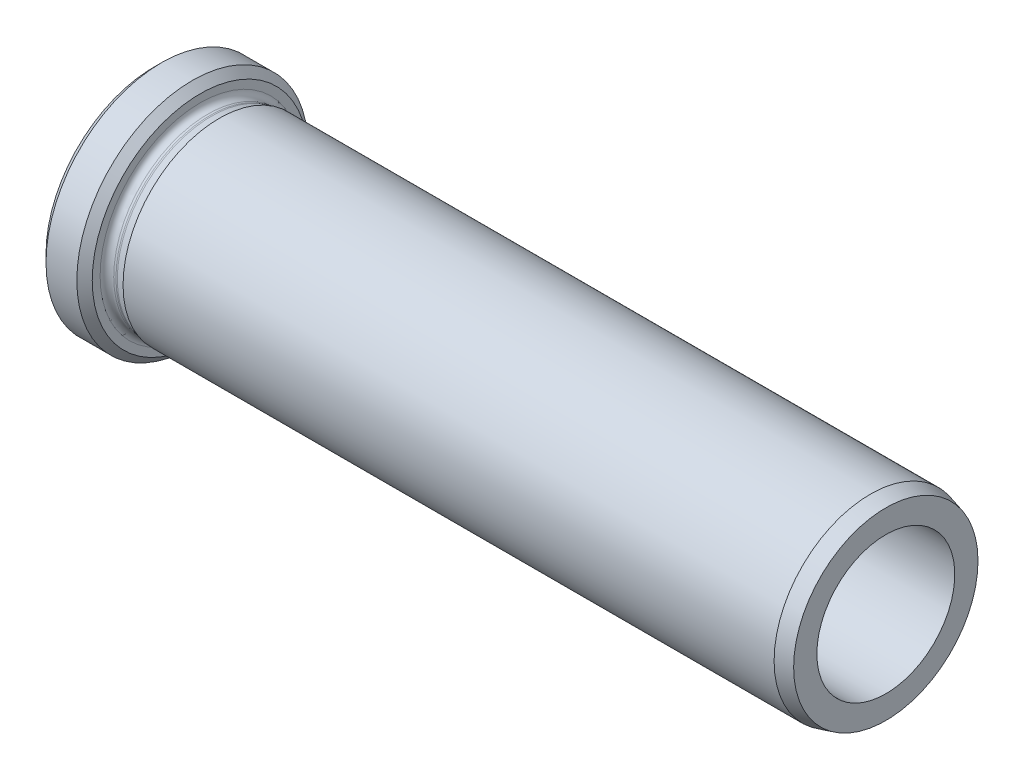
ISO-10303-21;
HEADER;
FILE_DESCRIPTION(('STEP AP214'),'2;1');
FILE_NAME('part.step','',(''),(''),'','','');
FILE_SCHEMA(('AUTOMOTIVE_DESIGN { 1 0 10303 214 1 1 1 1 }'));
ENDSEC;
DATA;
#1=APPLICATION_CONTEXT('core data for automotive mechanical design processes');
#2=APPLICATION_PROTOCOL_DEFINITION('international standard','automotive_design',2000,#1);
#3=PRODUCT_CONTEXT('',#1,'mechanical');
#4=PRODUCT('Part','Part','',(#3));
#5=PRODUCT_RELATED_PRODUCT_CATEGORY('part','',(#4));
#6=PRODUCT_DEFINITION_FORMATION('','',#4);
#7=PRODUCT_DEFINITION_CONTEXT('part definition',#1,'design');
#8=PRODUCT_DEFINITION('design','',#6,#7);
#9=PRODUCT_DEFINITION_SHAPE('','',#8);
#10=(LENGTH_UNIT() NAMED_UNIT(*) SI_UNIT(.MILLI.,.METRE.));
#11=(NAMED_UNIT(*) PLANE_ANGLE_UNIT() SI_UNIT($,.RADIAN.));
#12=(NAMED_UNIT(*) SI_UNIT($,.STERADIAN.) SOLID_ANGLE_UNIT());
#13=UNCERTAINTY_MEASURE_WITH_UNIT(LENGTH_MEASURE(1.E-05),#10,'distance_accuracy_value','');
#14=(GEOMETRIC_REPRESENTATION_CONTEXT(3) GLOBAL_UNCERTAINTY_ASSIGNED_CONTEXT((#13)) GLOBAL_UNIT_ASSIGNED_CONTEXT((#10,
#11,#12)) REPRESENTATION_CONTEXT('',''));
#15=CARTESIAN_POINT('',(0.,0.,0.));
#16=DIRECTION('',(0.,0.,1.));
#17=DIRECTION('',(1.,0.,0.));
#18=AXIS2_PLACEMENT_3D('',#15,#16,#17);
#19=CARTESIAN_POINT('',(30.7294388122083,8.95,0.));
#20=DIRECTION('',(1.,0.,0.));
#21=DIRECTION('',(0.,0.,-1.));
#22=AXIS2_PLACEMENT_3D('',#19,#20,#21);
#23=PLANE('',#22);
#24=CARTESIAN_POINT('',(30.7294388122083,0.,0.));
#25=DIRECTION('',(-1.,0.,0.));
#26=DIRECTION('',(0.,0.,1.));
#27=AXIS2_PLACEMENT_3D('',#24,#25,#26);
#28=CIRCLE('',#27,8.95);
#29=CARTESIAN_POINT('',(30.7294388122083,0.,8.95));
#30=VERTEX_POINT('',#29);
#31=EDGE_CURVE('E40',#30,#30,#28,.T.);
#32=ORIENTED_EDGE('',*,*,#31,.F.);
#33=EDGE_LOOP('',(#32));
#34=FACE_BOUND('',#33,.T.);
#35=CARTESIAN_POINT('',(30.7294388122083,0.,0.));
#36=DIRECTION('',(-1.,0.,0.));
#37=DIRECTION('',(0.,0.,1.));
#38=AXIS2_PLACEMENT_3D('',#35,#36,#37);
#39=CIRCLE('',#38,9.);
#40=CARTESIAN_POINT('',(30.7294388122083,0.,9.));
#41=VERTEX_POINT('',#40);
#42=EDGE_CURVE('E67',#41,#41,#39,.T.);
#43=ORIENTED_EDGE('',*,*,#42,.T.);
#44=EDGE_LOOP('',(#43));
#45=FACE_BOUND('',#44,.T.);
#46=ADVANCED_FACE('F14',(#34,#45),#23,.F.);
#47=CARTESIAN_POINT('',(0.,0.,0.));
#48=DIRECTION('',(-1.,0.,0.));
#49=DIRECTION('',(0.,0.,1.));
#50=AXIS2_PLACEMENT_3D('',#47,#48,#49);
#51=CYLINDRICAL_SURFACE('',#50,8.95);
#52=CARTESIAN_POINT('',(95.7294388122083,0.,0.));
#53=DIRECTION('',(-1.,0.,0.));
#54=DIRECTION('',(0.,0.,1.));
#55=AXIS2_PLACEMENT_3D('',#52,#53,#54);
#56=CIRCLE('',#55,8.95);
#57=CARTESIAN_POINT('',(95.7294388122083,0.,8.95));
#58=VERTEX_POINT('',#57);
#59=EDGE_CURVE('E43',#58,#58,#56,.T.);
#60=ORIENTED_EDGE('',*,*,#59,.F.);
#61=EDGE_LOOP('',(#60));
#62=FACE_BOUND('',#61,.T.);
#63=ORIENTED_EDGE('',*,*,#31,.T.);
#64=EDGE_LOOP('',(#63));
#65=FACE_BOUND('',#64,.T.);
#66=ADVANCED_FACE('F91',(#62,#65),#51,.F.);
#67=CARTESIAN_POINT('',(95.7294388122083,11.9641016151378,0.));
#68=DIRECTION('',(-1.,0.,0.));
#69=DIRECTION('',(0.,0.,1.));
#70=AXIS2_PLACEMENT_3D('',#67,#68,#69);
#71=PLANE('',#70);
#72=CARTESIAN_POINT('',(95.7294388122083,0.,0.));
#73=DIRECTION('',(-1.,0.,0.));
#74=DIRECTION('',(0.,0.,1.));
#75=AXIS2_PLACEMENT_3D('',#72,#73,#74);
#76=CIRCLE('',#75,11.9641016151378);
#77=CARTESIAN_POINT('',(95.7294388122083,0.,11.9641016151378));
#78=VERTEX_POINT('',#77);
#79=EDGE_CURVE('E46',#78,#78,#76,.T.);
#80=ORIENTED_EDGE('',*,*,#79,.F.);
#81=EDGE_LOOP('',(#80));
#82=FACE_BOUND('',#81,.T.);
#83=ORIENTED_EDGE('',*,*,#59,.T.);
#84=EDGE_LOOP('',(#83));
#85=FACE_BOUND('',#84,.T.);
#86=ADVANCED_FACE('F98',(#82,#85),#71,.F.);
#87=CARTESIAN_POINT('',(95.7294388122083,0.,0.));
#88=DIRECTION('',(-1.,0.,0.));
#89=DIRECTION('',(0.,0.,1.));
#90=AXIS2_PLACEMENT_3D('',#87,#88,#89);
#91=CONICAL_SURFACE('',#90,11.9641016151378,0.261799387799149);
#92=CARTESIAN_POINT('',(93.7294388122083,0.,0.));
#93=DIRECTION('',(-1.,0.,0.));
#94=DIRECTION('',(0.,0.,1.));
#95=AXIS2_PLACEMENT_3D('',#92,#93,#94);
#96=CIRCLE('',#95,12.5);
#97=CARTESIAN_POINT('',(93.7294388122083,0.,12.5));
#98=VERTEX_POINT('',#97);
#99=EDGE_CURVE('E49',#98,#98,#96,.T.);
#100=ORIENTED_EDGE('',*,*,#99,.F.);
#101=EDGE_LOOP('',(#100));
#102=FACE_BOUND('',#101,.T.);
#103=ORIENTED_EDGE('',*,*,#79,.T.);
#104=EDGE_LOOP('',(#103));
#105=FACE_BOUND('',#104,.T.);
#106=ADVANCED_FACE('F196',(#102,#105),#91,.T.);
#107=CARTESIAN_POINT('',(0.,0.,0.));
#108=DIRECTION('',(-1.,0.,0.));
#109=DIRECTION('',(0.,0.,1.));
#110=AXIS2_PLACEMENT_3D('',#107,#108,#109);
#111=CYLINDRICAL_SURFACE('',#110,12.5);
#112=CARTESIAN_POINT('',(9.22943881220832,0.,0.));
#113=DIRECTION('',(-1.,0.,0.));
#114=DIRECTION('',(0.,0.,1.));
#115=AXIS2_PLACEMENT_3D('',#112,#113,#114);
#116=CIRCLE('',#115,12.5);
#117=CARTESIAN_POINT('',(9.22943881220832,0.,12.5));
#118=VERTEX_POINT('',#117);
#119=EDGE_CURVE('E52',#118,#118,#116,.T.);
#120=ORIENTED_EDGE('',*,*,#119,.F.);
#121=EDGE_LOOP('',(#120));
#122=FACE_BOUND('',#121,.T.);
#123=ORIENTED_EDGE('',*,*,#99,.T.);
#124=EDGE_LOOP('',(#123));
#125=FACE_BOUND('',#124,.T.);
#126=ADVANCED_FACE('F186',(#122,#125),#111,.T.);
#127=CARTESIAN_POINT('',(9.22943881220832,0.,0.));
#128=DIRECTION('',(1.,0.,0.));
#129=DIRECTION('',(0.,0.,-1.));
#130=AXIS2_PLACEMENT_3D('',#127,#128,#129);
#131=CONICAL_SURFACE('',#130,12.5,0.261799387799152);
#132=CARTESIAN_POINT('',(8.21155680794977,0.,0.));
#133=DIRECTION('',(-1.,0.,0.));
#134=DIRECTION('',(0.,0.,1.));
#135=AXIS2_PLACEMENT_3D('',#132,#133,#134);
#136=CIRCLE('',#135,12.2272593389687);
#137=CARTESIAN_POINT('',(8.21155680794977,0.,12.2272593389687));
#138=VERTEX_POINT('',#137);
#139=EDGE_CURVE('E55',#138,#138,#136,.T.);
#140=ORIENTED_EDGE('',*,*,#139,.F.);
#141=EDGE_LOOP('',(#140));
#142=FACE_BOUND('',#141,.T.);
#143=ORIENTED_EDGE('',*,*,#119,.T.);
#144=EDGE_LOOP('',(#143));
#145=FACE_BOUND('',#144,.T.);
#146=ADVANCED_FACE('F176',(#142,#145),#131,.T.);
#147=CARTESIAN_POINT('',(8.00450157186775,0.,0.));
#148=DIRECTION('',(-1.,0.,0.));
#149=DIRECTION('',(0.,0.,1.));
#150=AXIS2_PLACEMENT_3D('',#147,#148,#149);
#151=TOROIDAL_SURFACE('',#150,13.,0.8);
#152=CARTESIAN_POINT('',(8.00450157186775,0.,0.));
#153=DIRECTION('',(-1.,0.,0.));
#154=DIRECTION('',(0.,0.,1.));
#155=AXIS2_PLACEMENT_3D('',#152,#153,#154);
#156=CIRCLE('',#155,12.2);
#157=CARTESIAN_POINT('',(8.00450157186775,0.,12.2));
#158=VERTEX_POINT('',#157);
#159=EDGE_CURVE('E58',#158,#158,#156,.T.);
#160=ORIENTED_EDGE('',*,*,#159,.F.);
#161=EDGE_LOOP('',(#160));
#162=FACE_BOUND('',#161,.T.);
#163=ORIENTED_EDGE('',*,*,#139,.T.);
#164=EDGE_LOOP('',(#163));
#165=FACE_BOUND('',#164,.T.);
#166=ADVANCED_FACE('F166',(#162,#165),#151,.F.);
#167=CARTESIAN_POINT('',(0.,0.,0.));
#168=DIRECTION('',(-1.,0.,0.));
#169=DIRECTION('',(0.,0.,1.));
#170=AXIS2_PLACEMENT_3D('',#167,#168,#169);
#171=CYLINDRICAL_SURFACE('',#170,12.2);
#172=CARTESIAN_POINT('',(7.71563055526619,0.,0.));
#173=DIRECTION('',(-1.,0.,0.));
#174=DIRECTION('',(0.,0.,1.));
#175=AXIS2_PLACEMENT_3D('',#172,#173,#174);
#176=CIRCLE('',#175,12.2);
#177=CARTESIAN_POINT('',(7.71563055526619,0.,12.2));
#178=VERTEX_POINT('',#177);
#179=EDGE_CURVE('E61',#178,#178,#176,.T.);
#180=ORIENTED_EDGE('',*,*,#179,.F.);
#181=EDGE_LOOP('',(#180));
#182=FACE_BOUND('',#181,.T.);
#183=ORIENTED_EDGE('',*,*,#159,.T.);
#184=EDGE_LOOP('',(#183));
#185=FACE_BOUND('',#184,.T.);
#186=ADVANCED_FACE('F156',(#182,#185),#171,.T.);
#187=CARTESIAN_POINT('',(7.52943881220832,0.,0.));
#188=DIRECTION('',(-1.,0.,0.));
#189=DIRECTION('',(0.,0.,1.));
#190=AXIS2_PLACEMENT_3D('',#187,#188,#189);
#191=TOROIDAL_SURFACE('',#190,12.9780312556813,0.8);
#192=CARTESIAN_POINT('',(6.72943881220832,0.,0.));
#193=DIRECTION('',(-1.,0.,0.));
#194=DIRECTION('',(0.,0.,1.));
#195=AXIS2_PLACEMENT_3D('',#192,#193,#194);
#196=CIRCLE('',#195,12.9780312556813);
#197=CARTESIAN_POINT('',(6.72943881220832,0.,12.9780312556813));
#198=VERTEX_POINT('',#197);
#199=EDGE_CURVE('E64',#198,#198,#196,.T.);
#200=ORIENTED_EDGE('',*,*,#199,.F.);
#201=EDGE_LOOP('',(#200));
#202=FACE_BOUND('',#201,.T.);
#203=ORIENTED_EDGE('',*,*,#179,.T.);
#204=EDGE_LOOP('',(#203));
#205=FACE_BOUND('',#204,.T.);
#206=ADVANCED_FACE('F147',(#202,#205),#191,.F.);
#207=CARTESIAN_POINT('',(6.72943881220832,15.,0.));
#208=DIRECTION('',(-1.,0.,0.));
#209=DIRECTION('',(0.,0.,1.));
#210=AXIS2_PLACEMENT_3D('',#207,#208,#209);
#211=PLANE('',#210);
#212=CARTESIAN_POINT('',(6.72943881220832,0.,0.));
#213=DIRECTION('',(-1.,0.,0.));
#214=DIRECTION('',(0.,0.,1.));
#215=AXIS2_PLACEMENT_3D('',#212,#213,#214);
#216=CIRCLE('',#215,14.);
#217=CARTESIAN_POINT('',(6.72943881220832,0.,14.));
#218=VERTEX_POINT('',#217);
#219=EDGE_CURVE('E9',#218,#218,#216,.F.);
#220=ORIENTED_EDGE('',*,*,#219,.T.);
#221=EDGE_LOOP('',(#220));
#222=FACE_BOUND('',#221,.T.);
#223=ORIENTED_EDGE('',*,*,#199,.T.);
#224=EDGE_LOOP('',(#223));
#225=FACE_BOUND('',#224,.T.);
#226=ADVANCED_FACE('F137',(#222,#225),#211,.F.);
#227=CARTESIAN_POINT('',(0.,0.,0.));
#228=DIRECTION('',(-1.,0.,0.));
#229=DIRECTION('',(0.,0.,1.));
#230=AXIS2_PLACEMENT_3D('',#227,#228,#229);
#231=CYLINDRICAL_SURFACE('',#230,15.);
#232=CARTESIAN_POINT('',(5.72943881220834,0.,0.));
#233=DIRECTION('',(-1.,0.,0.));
#234=DIRECTION('',(0.,0.,1.));
#235=AXIS2_PLACEMENT_3D('',#232,#233,#234);
#236=CIRCLE('',#235,15.);
#237=CARTESIAN_POINT('',(5.72943881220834,0.,15.));
#238=VERTEX_POINT('',#237);
#239=EDGE_CURVE('E21',#238,#238,#236,.T.);
#240=ORIENTED_EDGE('',*,*,#239,.T.);
#241=EDGE_LOOP('',(#240));
#242=FACE_BOUND('',#241,.T.);
#243=CARTESIAN_POINT('',(1.72943881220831,0.,0.));
#244=DIRECTION('',(1.,0.,0.));
#245=DIRECTION('',(0.,0.,-1.));
#246=AXIS2_PLACEMENT_3D('',#243,#244,#245);
#247=CIRCLE('',#246,15.);
#248=CARTESIAN_POINT('',(1.72943881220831,0.,-15.));
#249=VERTEX_POINT('',#248);
#250=EDGE_CURVE('E34',#249,#249,#247,.T.);
#251=ORIENTED_EDGE('',*,*,#250,.T.);
#252=EDGE_LOOP('',(#251));
#253=FACE_BOUND('',#252,.T.);
#254=ADVANCED_FACE('F87',(#242,#253),#231,.T.);
#255=CARTESIAN_POINT('',(0.729438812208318,15.,0.));
#256=DIRECTION('',(1.,0.,0.));
#257=DIRECTION('',(0.,0.,-1.));
#258=AXIS2_PLACEMENT_3D('',#255,#256,#257);
#259=PLANE('',#258);
#260=CARTESIAN_POINT('',(0.729438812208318,0.,0.));
#261=DIRECTION('',(1.,0.,0.));
#262=DIRECTION('',(0.,0.,-1.));
#263=AXIS2_PLACEMENT_3D('',#260,#261,#262);
#264=CIRCLE('',#263,10.5);
#265=CARTESIAN_POINT('',(0.729438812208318,0.,-10.5));
#266=VERTEX_POINT('',#265);
#267=EDGE_CURVE('E25',#266,#266,#264,.T.);
#268=ORIENTED_EDGE('',*,*,#267,.T.);
#269=EDGE_LOOP('',(#268));
#270=FACE_BOUND('',#269,.T.);
#271=CARTESIAN_POINT('',(0.729438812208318,0.,0.));
#272=DIRECTION('',(1.,0.,0.));
#273=DIRECTION('',(0.,0.,-1.));
#274=AXIS2_PLACEMENT_3D('',#271,#272,#273);
#275=CIRCLE('',#274,14.);
#276=CARTESIAN_POINT('',(0.729438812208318,0.,-14.));
#277=VERTEX_POINT('',#276);
#278=EDGE_CURVE('E37',#277,#277,#275,.F.);
#279=ORIENTED_EDGE('',*,*,#278,.T.);
#280=EDGE_LOOP('',(#279));
#281=FACE_BOUND('',#280,.T.);
#282=ADVANCED_FACE('F75',(#270,#281),#259,.F.);
#283=CARTESIAN_POINT('',(0.,0.,0.));
#284=DIRECTION('',(-1.,0.,0.));
#285=DIRECTION('',(0.,0.,1.));
#286=AXIS2_PLACEMENT_3D('',#283,#284,#285);
#287=CYLINDRICAL_SURFACE('',#286,9.);
#288=CARTESIAN_POINT('',(2.22943881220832,0.,0.));
#289=DIRECTION('',(1.,0.,0.));
#290=DIRECTION('',(0.,0.,-1.));
#291=AXIS2_PLACEMENT_3D('',#288,#289,#290);
#292=CIRCLE('',#291,9.);
#293=CARTESIAN_POINT('',(2.22943881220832,0.,-9.));
#294=VERTEX_POINT('',#293);
#295=EDGE_CURVE('E29',#294,#294,#292,.F.);
#296=ORIENTED_EDGE('',*,*,#295,.T.);
#297=EDGE_LOOP('',(#296));
#298=FACE_BOUND('',#297,.T.);
#299=ORIENTED_EDGE('',*,*,#42,.F.);
#300=EDGE_LOOP('',(#299));
#301=FACE_BOUND('',#300,.T.);
#302=ADVANCED_FACE('F72',(#298,#301),#287,.F.);
#303=CARTESIAN_POINT('',(0.729438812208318,0.,0.));
#304=DIRECTION('',(1.,0.,0.));
#305=DIRECTION('',(0.,0.,-1.));
#306=AXIS2_PLACEMENT_3D('',#303,#304,#305);
#307=CONICAL_SURFACE('',#306,14.,0.785398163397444);
#308=ORIENTED_EDGE('',*,*,#250,.F.);
#309=EDGE_LOOP('',(#308));
#310=FACE_BOUND('',#309,.T.);
#311=ORIENTED_EDGE('',*,*,#278,.F.);
#312=EDGE_LOOP('',(#311));
#313=FACE_BOUND('',#312,.T.);
#314=ADVANCED_FACE('F74',(#310,#313),#307,.T.);
#315=CARTESIAN_POINT('',(2.22943881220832,0.,0.));
#316=DIRECTION('',(1.,0.,0.));
#317=DIRECTION('',(0.,0.,-1.));
#318=AXIS2_PLACEMENT_3D('',#315,#316,#317);
#319=TOROIDAL_SURFACE('',#318,10.5,1.5);
#320=ORIENTED_EDGE('',*,*,#267,.F.);
#321=EDGE_LOOP('',(#320));
#322=FACE_BOUND('',#321,.T.);
#323=ORIENTED_EDGE('',*,*,#295,.F.);
#324=EDGE_LOOP('',(#323));
#325=FACE_BOUND('',#324,.T.);
#326=ADVANCED_FACE('F84',(#322,#325),#319,.T.);
#327=CARTESIAN_POINT('',(5.72943881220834,0.,0.));
#328=DIRECTION('',(-1.,0.,0.));
#329=DIRECTION('',(0.,0.,1.));
#330=AXIS2_PLACEMENT_3D('',#327,#328,#329);
#331=CONICAL_SURFACE('',#330,15.,0.785398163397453);
#332=ORIENTED_EDGE('',*,*,#219,.F.);
#333=EDGE_LOOP('',(#332));
#334=FACE_BOUND('',#333,.T.);
#335=ORIENTED_EDGE('',*,*,#239,.F.);
#336=EDGE_LOOP('',(#335));
#337=FACE_BOUND('',#336,.T.);
#338=ADVANCED_FACE('F16',(#334,#337),#331,.T.);
#339=CLOSED_SHELL('',(#46,#66,#86,#106,#126,#146,#166,#186,#206,#226,#254,#282,#302,#314,#326,#338));
#340=MANIFOLD_SOLID_BREP('B1',#339);
#341=ADVANCED_BREP_SHAPE_REPRESENTATION('',(#18,#340),#14);
#342=SHAPE_DEFINITION_REPRESENTATION(#9,#341);
ENDSEC;
END-ISO-10303-21;
